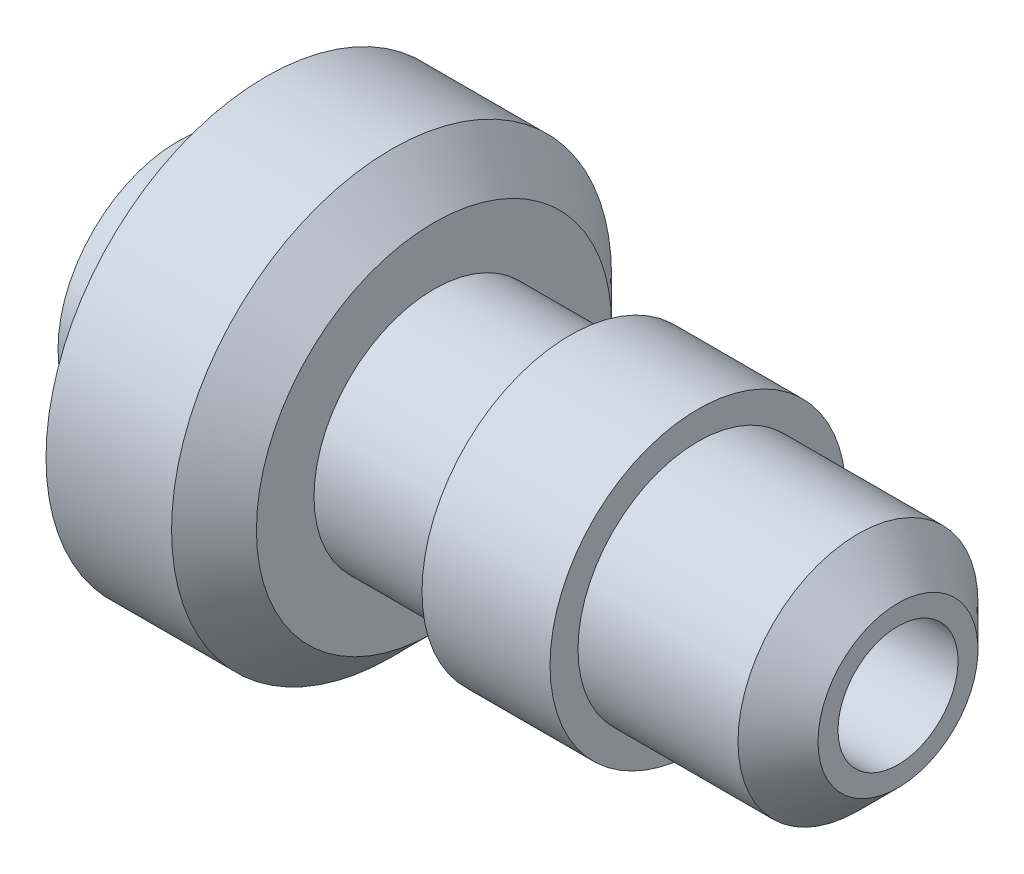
ISO-10303-21;
HEADER;
FILE_DESCRIPTION(('STEP AP214'),'2;1');
FILE_NAME('part.step','',(''),(''),'','','');
FILE_SCHEMA(('AUTOMOTIVE_DESIGN { 1 0 10303 214 1 1 1 1 }'));
ENDSEC;
DATA;
#1=APPLICATION_CONTEXT('core data for automotive mechanical design processes');
#2=APPLICATION_PROTOCOL_DEFINITION('international standard','automotive_design',2000,#1);
#3=PRODUCT_CONTEXT('',#1,'mechanical');
#4=PRODUCT('Part','Part','',(#3));
#5=PRODUCT_RELATED_PRODUCT_CATEGORY('part','',(#4));
#6=PRODUCT_DEFINITION_FORMATION('','',#4);
#7=PRODUCT_DEFINITION_CONTEXT('part definition',#1,'design');
#8=PRODUCT_DEFINITION('design','',#6,#7);
#9=PRODUCT_DEFINITION_SHAPE('','',#8);
#10=(LENGTH_UNIT() NAMED_UNIT(*) SI_UNIT(.MILLI.,.METRE.));
#11=(NAMED_UNIT(*) PLANE_ANGLE_UNIT() SI_UNIT($,.RADIAN.));
#12=(NAMED_UNIT(*) SI_UNIT($,.STERADIAN.) SOLID_ANGLE_UNIT());
#13=UNCERTAINTY_MEASURE_WITH_UNIT(LENGTH_MEASURE(1.E-05),#10,'distance_accuracy_value','');
#14=(GEOMETRIC_REPRESENTATION_CONTEXT(3) GLOBAL_UNCERTAINTY_ASSIGNED_CONTEXT((#13)) GLOBAL_UNIT_ASSIGNED_CONTEXT((#10,
#11,#12)) REPRESENTATION_CONTEXT('',''));
#15=CARTESIAN_POINT('',(0.,0.,0.));
#16=DIRECTION('',(0.,0.,1.));
#17=DIRECTION('',(1.,0.,0.));
#18=AXIS2_PLACEMENT_3D('',#15,#16,#17);
#19=CARTESIAN_POINT('',(0.,30.,0.));
#20=DIRECTION('',(1.,0.,0.));
#21=DIRECTION('',(0.,0.,-1.));
#22=AXIS2_PLACEMENT_3D('',#19,#20,#21);
#23=PLANE('',#22);
#24=CARTESIAN_POINT('',(0.,0.,0.));
#25=DIRECTION('',(-1.,0.,0.));
#26=DIRECTION('',(0.,0.,1.));
#27=AXIS2_PLACEMENT_3D('',#24,#25,#26);
#28=CIRCLE('',#27,30.);
#29=CARTESIAN_POINT('',(0.,0.,30.));
#30=VERTEX_POINT('',#29);
#31=EDGE_CURVE('E72',#30,#30,#28,.T.);
#32=ORIENTED_EDGE('',*,*,#31,.T.);
#33=EDGE_LOOP('',(#32));
#34=FACE_BOUND('',#33,.T.);
#35=ADVANCED_FACE('F26',(#34),#23,.F.);
#36=CARTESIAN_POINT('',(128.,0.,0.));
#37=DIRECTION('',(-1.,0.,0.));
#38=DIRECTION('',(0.,0.,1.));
#39=AXIS2_PLACEMENT_3D('',#36,#37,#38);
#40=PLANE('',#39);
#41=CARTESIAN_POINT('',(128.,0.,0.));
#42=DIRECTION('',(-1.,0.,0.));
#43=DIRECTION('',(0.,0.,1.));
#44=AXIS2_PLACEMENT_3D('',#41,#42,#43);
#45=CIRCLE('',#44,15.);
#46=CARTESIAN_POINT('',(128.,0.,15.));
#47=VERTEX_POINT('',#46);
#48=EDGE_CURVE('E10',#47,#47,#45,.T.);
#49=ORIENTED_EDGE('',*,*,#48,.F.);
#50=EDGE_LOOP('',(#49));
#51=FACE_BOUND('',#50,.T.);
#52=ADVANCED_FACE('F150',(#51),#40,.F.);
#53=CARTESIAN_POINT('',(0.,0.,0.));
#54=DIRECTION('',(-1.,0.,0.));
#55=DIRECTION('',(0.,0.,1.));
#56=AXIS2_PLACEMENT_3D('',#53,#54,#55);
#57=CYLINDRICAL_SURFACE('',#56,15.);
#58=CARTESIAN_POINT('',(180.,0.,0.));
#59=DIRECTION('',(-1.,0.,0.));
#60=DIRECTION('',(0.,0.,1.));
#61=AXIS2_PLACEMENT_3D('',#58,#59,#60);
#62=CIRCLE('',#61,15.);
#63=CARTESIAN_POINT('',(180.,0.,15.));
#64=VERTEX_POINT('',#63);
#65=EDGE_CURVE('E32',#64,#64,#62,.T.);
#66=ORIENTED_EDGE('',*,*,#65,.F.);
#67=EDGE_LOOP('',(#66));
#68=FACE_BOUND('',#67,.T.);
#69=ORIENTED_EDGE('',*,*,#48,.T.);
#70=EDGE_LOOP('',(#69));
#71=FACE_BOUND('',#70,.T.);
#72=ADVANCED_FACE('F145',(#68,#71),#57,.F.);
#73=CARTESIAN_POINT('',(180.,15.,0.));
#74=DIRECTION('',(-1.,0.,0.));
#75=DIRECTION('',(0.,0.,1.));
#76=AXIS2_PLACEMENT_3D('',#73,#74,#75);
#77=PLANE('',#76);
#78=CARTESIAN_POINT('',(180.,0.,0.));
#79=DIRECTION('',(-1.,0.,0.));
#80=DIRECTION('',(0.,0.,1.));
#81=AXIS2_PLACEMENT_3D('',#78,#79,#80);
#82=CIRCLE('',#81,20.);
#83=CARTESIAN_POINT('',(180.,0.,20.));
#84=VERTEX_POINT('',#83);
#85=EDGE_CURVE('E36',#84,#84,#82,.T.);
#86=ORIENTED_EDGE('',*,*,#85,.F.);
#87=EDGE_LOOP('',(#86));
#88=FACE_BOUND('',#87,.T.);
#89=ORIENTED_EDGE('',*,*,#65,.T.);
#90=EDGE_LOOP('',(#89));
#91=FACE_BOUND('',#90,.T.);
#92=ADVANCED_FACE('F140',(#88,#91),#77,.F.);
#93=CARTESIAN_POINT('',(180.,0.,0.));
#94=DIRECTION('',(-1.,0.,0.));
#95=DIRECTION('',(0.,0.,1.));
#96=AXIS2_PLACEMENT_3D('',#93,#94,#95);
#97=CONICAL_SURFACE('',#96,20.,0.785398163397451);
#98=CARTESIAN_POINT('',(170.,0.,0.));
#99=DIRECTION('',(-1.,0.,0.));
#100=DIRECTION('',(0.,0.,1.));
#101=AXIS2_PLACEMENT_3D('',#98,#99,#100);
#102=CIRCLE('',#101,30.);
#103=CARTESIAN_POINT('',(170.,0.,30.));
#104=VERTEX_POINT('',#103);
#105=EDGE_CURVE('E40',#104,#104,#102,.T.);
#106=ORIENTED_EDGE('',*,*,#105,.F.);
#107=EDGE_LOOP('',(#106));
#108=FACE_BOUND('',#107,.T.);
#109=ORIENTED_EDGE('',*,*,#85,.T.);
#110=EDGE_LOOP('',(#109));
#111=FACE_BOUND('',#110,.T.);
#112=ADVANCED_FACE('F134',(#108,#111),#97,.T.);
#113=CARTESIAN_POINT('',(0.,0.,0.));
#114=DIRECTION('',(-1.,0.,0.));
#115=DIRECTION('',(0.,0.,1.));
#116=AXIS2_PLACEMENT_3D('',#113,#114,#115);
#117=CYLINDRICAL_SURFACE('',#116,30.);
#118=CARTESIAN_POINT('',(130.,0.,0.));
#119=DIRECTION('',(-1.,0.,0.));
#120=DIRECTION('',(0.,0.,1.));
#121=AXIS2_PLACEMENT_3D('',#118,#119,#120);
#122=CIRCLE('',#121,30.);
#123=CARTESIAN_POINT('',(130.,0.,30.));
#124=VERTEX_POINT('',#123);
#125=EDGE_CURVE('E45',#124,#124,#122,.T.);
#126=ORIENTED_EDGE('',*,*,#125,.F.);
#127=EDGE_LOOP('',(#126));
#128=FACE_BOUND('',#127,.T.);
#129=ORIENTED_EDGE('',*,*,#105,.T.);
#130=EDGE_LOOP('',(#129));
#131=FACE_BOUND('',#130,.T.);
#132=ADVANCED_FACE('F128',(#128,#131),#117,.T.);
#133=CARTESIAN_POINT('',(130.,30.,0.));
#134=DIRECTION('',(-1.,0.,0.));
#135=DIRECTION('',(0.,0.,1.));
#136=AXIS2_PLACEMENT_3D('',#133,#134,#135);
#137=PLANE('',#136);
#138=CARTESIAN_POINT('',(130.,0.,0.));
#139=DIRECTION('',(-1.,0.,0.));
#140=DIRECTION('',(0.,0.,1.));
#141=AXIS2_PLACEMENT_3D('',#138,#139,#140);
#142=CIRCLE('',#141,37.);
#143=CARTESIAN_POINT('',(130.,0.,37.));
#144=VERTEX_POINT('',#143);
#145=EDGE_CURVE('E48',#144,#144,#142,.T.);
#146=ORIENTED_EDGE('',*,*,#145,.F.);
#147=EDGE_LOOP('',(#146));
#148=FACE_BOUND('',#147,.T.);
#149=ORIENTED_EDGE('',*,*,#125,.T.);
#150=EDGE_LOOP('',(#149));
#151=FACE_BOUND('',#150,.T.);
#152=ADVANCED_FACE('F122',(#148,#151),#137,.F.);
#153=CARTESIAN_POINT('',(0.,0.,0.));
#154=DIRECTION('',(-1.,0.,0.));
#155=DIRECTION('',(0.,0.,1.));
#156=AXIS2_PLACEMENT_3D('',#153,#154,#155);
#157=CYLINDRICAL_SURFACE('',#156,37.);
#158=CARTESIAN_POINT('',(98.,0.,0.));
#159=DIRECTION('',(-1.,0.,0.));
#160=DIRECTION('',(0.,0.,1.));
#161=AXIS2_PLACEMENT_3D('',#158,#159,#160);
#162=CIRCLE('',#161,37.);
#163=CARTESIAN_POINT('',(98.,0.,37.));
#164=VERTEX_POINT('',#163);
#165=EDGE_CURVE('E51',#164,#164,#162,.T.);
#166=ORIENTED_EDGE('',*,*,#165,.F.);
#167=EDGE_LOOP('',(#166));
#168=FACE_BOUND('',#167,.T.);
#169=ORIENTED_EDGE('',*,*,#145,.T.);
#170=EDGE_LOOP('',(#169));
#171=FACE_BOUND('',#170,.T.);
#172=ADVANCED_FACE('F116',(#168,#171),#157,.T.);
#173=CARTESIAN_POINT('',(98.,37.,0.));
#174=DIRECTION('',(1.,0.,0.));
#175=DIRECTION('',(0.,0.,-1.));
#176=AXIS2_PLACEMENT_3D('',#173,#174,#175);
#177=PLANE('',#176);
#178=CARTESIAN_POINT('',(98.,0.,0.));
#179=DIRECTION('',(-1.,0.,0.));
#180=DIRECTION('',(0.,0.,1.));
#181=AXIS2_PLACEMENT_3D('',#178,#179,#180);
#182=CIRCLE('',#181,30.);
#183=CARTESIAN_POINT('',(98.,0.,30.));
#184=VERTEX_POINT('',#183);
#185=EDGE_CURVE('E54',#184,#184,#182,.T.);
#186=ORIENTED_EDGE('',*,*,#185,.F.);
#187=EDGE_LOOP('',(#186));
#188=FACE_BOUND('',#187,.T.);
#189=ORIENTED_EDGE('',*,*,#165,.T.);
#190=EDGE_LOOP('',(#189));
#191=FACE_BOUND('',#190,.T.);
#192=ADVANCED_FACE('F110',(#188,#191),#177,.F.);
#193=CARTESIAN_POINT('',(0.,0.,0.));
#194=DIRECTION('',(-1.,0.,0.));
#195=DIRECTION('',(0.,0.,1.));
#196=AXIS2_PLACEMENT_3D('',#193,#194,#195);
#197=CYLINDRICAL_SURFACE('',#196,30.);
#198=CARTESIAN_POINT('',(64.,0.,0.));
#199=DIRECTION('',(-1.,0.,0.));
#200=DIRECTION('',(0.,0.,1.));
#201=AXIS2_PLACEMENT_3D('',#198,#199,#200);
#202=CIRCLE('',#201,30.);
#203=CARTESIAN_POINT('',(64.,0.,30.));
#204=VERTEX_POINT('',#203);
#205=EDGE_CURVE('E57',#204,#204,#202,.T.);
#206=ORIENTED_EDGE('',*,*,#205,.F.);
#207=EDGE_LOOP('',(#206));
#208=FACE_BOUND('',#207,.T.);
#209=ORIENTED_EDGE('',*,*,#185,.T.);
#210=EDGE_LOOP('',(#209));
#211=FACE_BOUND('',#210,.T.);
#212=ADVANCED_FACE('F104',(#208,#211),#197,.T.);
#213=CARTESIAN_POINT('',(64.,30.,0.));
#214=DIRECTION('',(-1.,0.,0.));
#215=DIRECTION('',(0.,0.,1.));
#216=AXIS2_PLACEMENT_3D('',#213,#214,#215);
#217=PLANE('',#216);
#218=CARTESIAN_POINT('',(64.,0.,0.));
#219=DIRECTION('',(-1.,0.,0.));
#220=DIRECTION('',(0.,0.,1.));
#221=AXIS2_PLACEMENT_3D('',#218,#219,#220);
#222=CIRCLE('',#221,44.3933982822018);
#223=CARTESIAN_POINT('',(64.,0.,44.3933982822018));
#224=VERTEX_POINT('',#223);
#225=EDGE_CURVE('E60',#224,#224,#222,.T.);
#226=ORIENTED_EDGE('',*,*,#225,.F.);
#227=EDGE_LOOP('',(#226));
#228=FACE_BOUND('',#227,.T.);
#229=ORIENTED_EDGE('',*,*,#205,.T.);
#230=EDGE_LOOP('',(#229));
#231=FACE_BOUND('',#230,.T.);
#232=ADVANCED_FACE('F98',(#228,#231),#217,.F.);
#233=CARTESIAN_POINT('',(64.,0.,0.));
#234=DIRECTION('',(-1.,0.,0.));
#235=DIRECTION('',(0.,0.,1.));
#236=AXIS2_PLACEMENT_3D('',#233,#234,#235);
#237=CONICAL_SURFACE('',#236,44.3933982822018,0.785398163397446);
#238=CARTESIAN_POINT('',(53.3933982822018,0.,0.));
#239=DIRECTION('',(-1.,0.,0.));
#240=DIRECTION('',(0.,0.,1.));
#241=AXIS2_PLACEMENT_3D('',#238,#239,#240);
#242=CIRCLE('',#241,55.);
#243=CARTESIAN_POINT('',(53.3933982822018,0.,55.));
#244=VERTEX_POINT('',#243);
#245=EDGE_CURVE('E63',#244,#244,#242,.T.);
#246=ORIENTED_EDGE('',*,*,#245,.F.);
#247=EDGE_LOOP('',(#246));
#248=FACE_BOUND('',#247,.T.);
#249=ORIENTED_EDGE('',*,*,#225,.T.);
#250=EDGE_LOOP('',(#249));
#251=FACE_BOUND('',#250,.T.);
#252=ADVANCED_FACE('F92',(#248,#251),#237,.T.);
#253=CARTESIAN_POINT('',(0.,0.,0.));
#254=DIRECTION('',(-1.,0.,0.));
#255=DIRECTION('',(0.,0.,1.));
#256=AXIS2_PLACEMENT_3D('',#253,#254,#255);
#257=CYLINDRICAL_SURFACE('',#256,55.);
#258=CARTESIAN_POINT('',(22.,0.,0.));
#259=DIRECTION('',(-1.,0.,0.));
#260=DIRECTION('',(0.,0.,1.));
#261=AXIS2_PLACEMENT_3D('',#258,#259,#260);
#262=CIRCLE('',#261,55.);
#263=CARTESIAN_POINT('',(22.,0.,55.));
#264=VERTEX_POINT('',#263);
#265=EDGE_CURVE('E66',#264,#264,#262,.T.);
#266=ORIENTED_EDGE('',*,*,#265,.F.);
#267=EDGE_LOOP('',(#266));
#268=FACE_BOUND('',#267,.T.);
#269=ORIENTED_EDGE('',*,*,#245,.T.);
#270=EDGE_LOOP('',(#269));
#271=FACE_BOUND('',#270,.T.);
#272=ADVANCED_FACE('F86',(#268,#271),#257,.T.);
#273=CARTESIAN_POINT('',(22.,55.,0.));
#274=DIRECTION('',(1.,0.,0.));
#275=DIRECTION('',(0.,0.,-1.));
#276=AXIS2_PLACEMENT_3D('',#273,#274,#275);
#277=PLANE('',#276);
#278=CARTESIAN_POINT('',(22.,0.,0.));
#279=DIRECTION('',(-1.,0.,0.));
#280=DIRECTION('',(0.,0.,1.));
#281=AXIS2_PLACEMENT_3D('',#278,#279,#280);
#282=CIRCLE('',#281,30.);
#283=CARTESIAN_POINT('',(22.,0.,30.));
#284=VERTEX_POINT('',#283);
#285=EDGE_CURVE('E69',#284,#284,#282,.T.);
#286=ORIENTED_EDGE('',*,*,#285,.F.);
#287=EDGE_LOOP('',(#286));
#288=FACE_BOUND('',#287,.T.);
#289=ORIENTED_EDGE('',*,*,#265,.T.);
#290=EDGE_LOOP('',(#289));
#291=FACE_BOUND('',#290,.T.);
#292=ADVANCED_FACE('F80',(#288,#291),#277,.F.);
#293=CARTESIAN_POINT('',(0.,0.,0.));
#294=DIRECTION('',(-1.,0.,0.));
#295=DIRECTION('',(0.,0.,1.));
#296=AXIS2_PLACEMENT_3D('',#293,#294,#295);
#297=CYLINDRICAL_SURFACE('',#296,30.);
#298=ORIENTED_EDGE('',*,*,#31,.F.);
#299=EDGE_LOOP('',(#298));
#300=FACE_BOUND('',#299,.T.);
#301=ORIENTED_EDGE('',*,*,#285,.T.);
#302=EDGE_LOOP('',(#301));
#303=FACE_BOUND('',#302,.T.);
#304=ADVANCED_FACE('F77',(#300,#303),#297,.T.);
#305=CLOSED_SHELL('',(#35,#52,#72,#92,#112,#132,#152,#172,#192,#212,#232,#252,#272,#292,#304));
#306=MANIFOLD_SOLID_BREP('B2',#305);
#307=ADVANCED_BREP_SHAPE_REPRESENTATION('',(#18,#306),#14);
#308=SHAPE_DEFINITION_REPRESENTATION(#9,#307);
ENDSEC;
END-ISO-10303-21;
